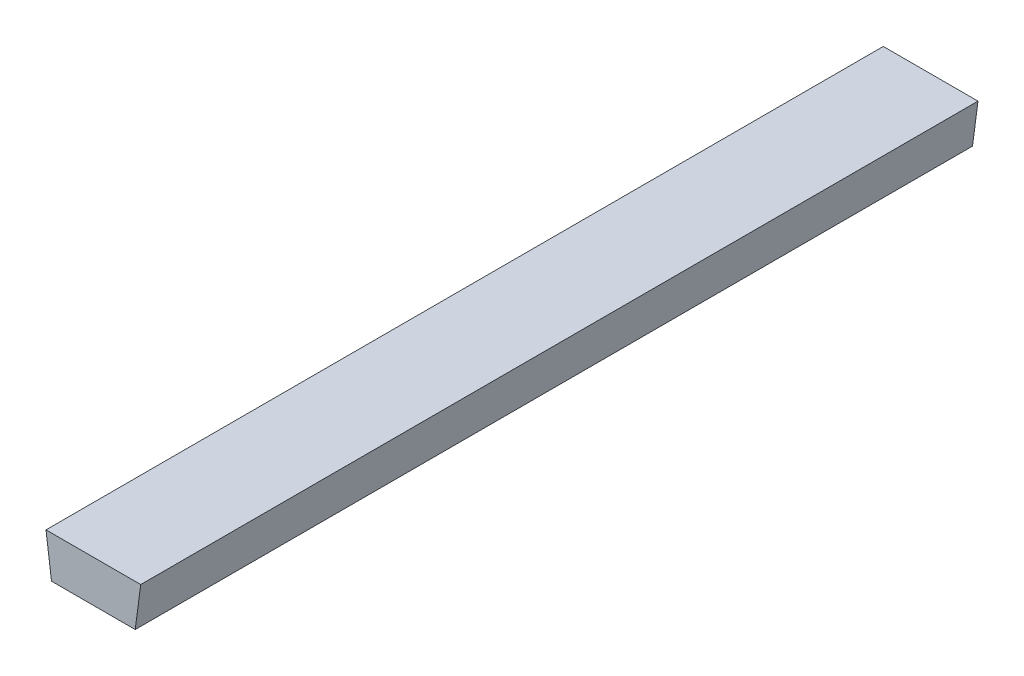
from build123d import *

# Parameters (mm, degrees)
EXTRUSION1_DEPTH = 400


with BuildPart() as part:
    # Esquisse3 → Extrusion1 (new body)
    with BuildSketch(Plane.XY):
        Polygon((-20, 0), (20, 0), (22.62490334, 19.938120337), (-22.62490334, 19.938120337), align=None)
    extrude(amount=EXTRUSION1_DEPTH)


solid = part.part
